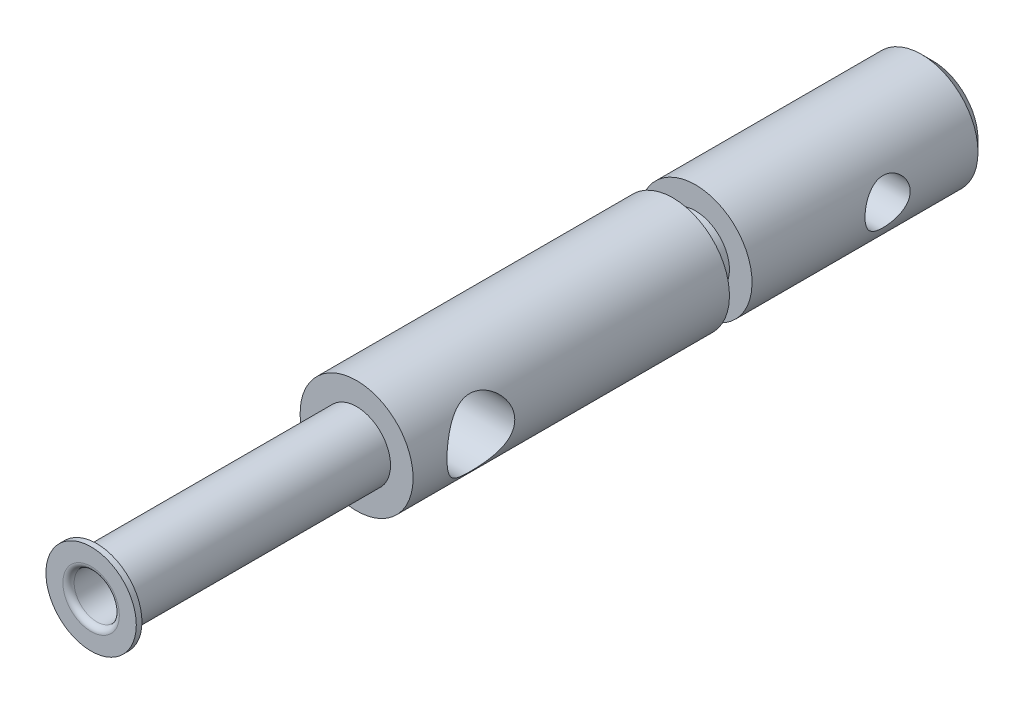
from build123d import *

# Parameters (mm, degrees)
ESQUISSE1_R                       = 5
EXTRUSION1_DEPTH                  = 51
CHANFREIN1_SIZE                   = 1
ESQUISSE2_R                       = 3
EXTRUSION2_DEPTH                  = 23
ESQUISSE3_R                       = 4
EXTRUSION3_DEPTH                  = 0.5
DIAM_TRE_DU_PER_AGE_4_0_4_1_D     = 4
DIAM_TRE_DU_PER_AGE_4_0_4_1_DEPTH = 5
DIAM_TRE_DU_PER_AGE_4_0_4_1_TIP   = 1.201721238
CONG_1_R                          = 0.5
ENL_V_MAT_EXTRU_1_DEPTH           = 75.8348181
ENL_V_MAT_EXTRU_1_DEPTH_BACK      = 75.8348181
ESQUISSE6_R                       = 2
ESQUISSE6_R_2                     = 3
ESQUISSE7_W                       = 2
ESQUISSE7_H                       = 2


with BuildPart() as part:
    # Esquisse1 → Extrusion1 (new body)
    with BuildSketch(Plane.XY):
        Circle(ESQUISSE1_R)
    extrude(amount=EXTRUSION1_DEPTH)

    # Chanfrein1
    chanfrein1_edges = [part.edges().sort_by_distance(p)[0] for p in [
        (-5, 0, 0),
    ]]
    chamfer(chanfrein1_edges, length=CHANFREIN1_SIZE)

    # Esquisse2 → Extrusion2 (add)
    with BuildSketch(Plane.XY.offset(51)):
        Circle(ESQUISSE2_R)
    extrude(amount=EXTRUSION2_DEPTH)

    # Esquisse3 → Extrusion3 (add)
    with BuildSketch(Plane.XY.offset(74)):
        Circle(ESQUISSE3_R)
    extrude(amount=EXTRUSION3_DEPTH)

    # Diam_tre du per_age _4.0 _4_1
    with Locations(Plane.XY.offset(74.5)):
        with Locations((0, 0)):
            Hole(DIAM_TRE_DU_PER_AGE_4_0_4_1_D / 2, depth=DIAM_TRE_DU_PER_AGE_4_0_4_1_DEPTH)
            with Locations((0, 0, -(DIAM_TRE_DU_PER_AGE_4_0_4_1_DEPTH + DIAM_TRE_DU_PER_AGE_4_0_4_1_TIP / 2))):  # 118° drill point
                Cone(0, DIAM_TRE_DU_PER_AGE_4_0_4_1_D / 2, DIAM_TRE_DU_PER_AGE_4_0_4_1_TIP, mode=Mode.SUBTRACT)

    # Cong_1
    cong_1_edges = [part.edges().sort_by_distance(p)[0] for p in [
        (2, 0, 74.5),
    ]]
    fillet(cong_1_edges, radius=CONG_1_R)

    # Esquisse6 → Enl_v. mat.-Extru.1 (cut, two sides: drawn at the far end of the back side and taken through both)
    with BuildSketch(Plane(origin=(0, 0, 0), x_dir=(0, 0, -1), z_dir=(1, 0, 0)).offset(-ENL_V_MAT_EXTRU_1_DEPTH_BACK)):
        with Locations(Location((-9, 0, 0), (0, 0, 180.000000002))):
            Circle(ESQUISSE6_R)
        with Locations(Location((-45, 0, 0), (0, 0, 179.999999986))):
            Circle(ESQUISSE6_R_2)
    extrude(amount=ENL_V_MAT_EXTRU_1_DEPTH + ENL_V_MAT_EXTRU_1_DEPTH_BACK, mode=Mode.SUBTRACT)

    # Esquisse7 → Enl_vement de mati_re-R_volution1 (revolve, cut)
    with BuildSketch(Plane(origin=(0, 0, 0), x_dir=(0, 0, -1), z_dir=(1, 0, 0))):
        with Locations((-22, 4)):
            Rectangle(ESQUISSE7_W, ESQUISSE7_H)
    revolve(axis=Axis((0, 0, 0), (0, 0, 1)), mode=Mode.SUBTRACT)


solid = part.part
